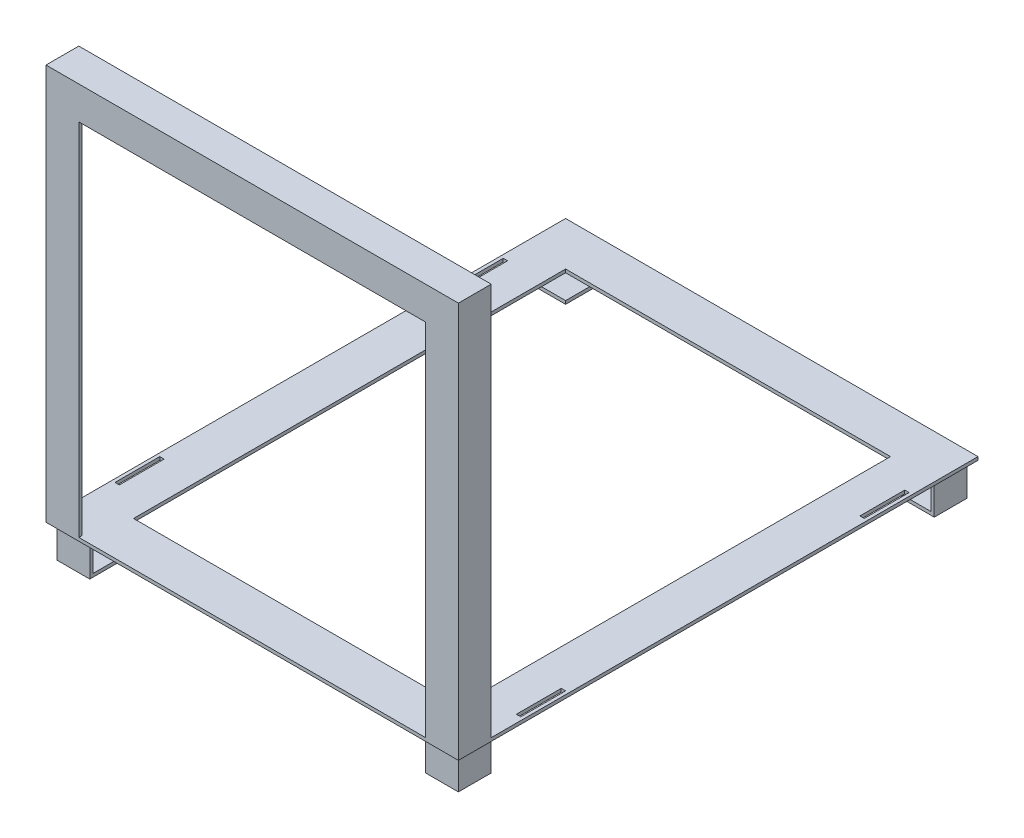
from build123d import *

# Parameters (mm, degrees)
SKETCH1_W           = 377
SKETCH1_H           = 475
SKETCH1_W_2         = 297
SKETCH1_H_2         = 395
BOSS_EXTRUDE1_DEPTH = 1.5
SKETCH2_W           = 4
SKETCH2_H           = 41
CUT_EXTRUDE1_DEPTH  = 3
BOSS_EXTRUDE2_DEPTH = 30
SKETCH4_W           = 30
SKETCH4_H           = 30
BOSS_EXTRUDE3_DEPTH = 3
BOSS_EXTRUDE4_DEPTH = 359
SKETCH6_W           = 377
SKETCH6_H           = 30
BOSS_EXTRUDE5_DEPTH = 3
SKETCH7_W           = 377
SKETCH7_H           = 30
BOSS_EXTRUDE6_DEPTH = 3


with BuildPart() as part:
    # Sketch1 → Boss-Extrude1 (new, symmetric)
    with BuildSketch(Plane(origin=(0, 0, 0), x_dir=(1, 0, 0), z_dir=(0, 1, 0))):
        Rectangle(SKETCH1_W, SKETCH1_H)
        Rectangle(SKETCH1_W_2, SKETCH1_H_2, mode=Mode.SUBTRACT)
    extrude(amount=BOSS_EXTRUDE1_DEPTH, both=True)

    # Sketch2 → Cut-Extrude1 (cut)
    with BuildSketch(Plane(origin=(0, 1.5, 0), x_dir=(1, 0, 0), z_dir=(0, 1, 0))):
        with Locations((183.5, -157)):
            Rectangle(SKETCH2_W, SKETCH2_H)
        with Locations((183.5, 157)):
            Rectangle(SKETCH2_W, SKETCH2_H)
        with Locations((-183.5, -157)):
            Rectangle(SKETCH2_W, SKETCH2_H)
        with Locations((-183.5, 157)):
            Rectangle(SKETCH2_W, SKETCH2_H)
    extrude(amount=-CUT_EXTRUDE1_DEPTH, mode=Mode.SUBTRACT)

    # Sketch3 → Boss-Extrude2 (add)
    with BuildSketch(Plane.XZ.offset(1.5)):
        Polygon((-183.5, 232.5), (-183.5, 202.5), (-180.5, 202.5), (-180.5, 229.5), (-153.5, 229.5), (-153.5, 232.5), align=None)
        Polygon((153.5, 232.5), (183.5, 232.5), (183.5, 202.5), (180.5, 202.5), (180.5, 229.5), (153.5, 229.5), align=None)
        Polygon((-183.5, -202.5), (-183.5, -232.5), (-153.5, -232.5), (-153.5, -229.5), (-180.5, -229.5), (-180.5, -202.5), align=None)
        Polygon((153.5, -229.5), (153.5, -232.5), (183.5, -232.5), (183.5, -202.5), (180.5, -202.5), (180.5, -229.5), align=None)
    extrude(amount=BOSS_EXTRUDE2_DEPTH)

    # Sketch4 → Boss-Extrude3 (add)
    with BuildSketch(Plane.XZ.offset(31.5)):
        with Locations((-168.5, -217.5)):
            Rectangle(SKETCH4_W, SKETCH4_H)
        with Locations((168.5, -217.5)):
            Rectangle(SKETCH4_W, SKETCH4_H)
        with Locations((168.5, 217.5)):
            Rectangle(SKETCH4_W, SKETCH4_H)
        with Locations((-168.5, 217.5)):
            Rectangle(SKETCH4_W, SKETCH4_H)
    extrude(amount=-BOSS_EXTRUDE3_DEPTH)

    # Sketch5 → Boss-Extrude4 (add)
    with BuildSketch(Plane(origin=(0, 1.5, 0), x_dir=(1, 0, 0), z_dir=(0, 1, 0))):
        Polygon((188.5, -237.5), (158.5, -237.5), (158.5, -234.5), (185.5, -234.5), (185.5, -207.5), (188.5, -207.5), align=None)
        Polygon((-188.5, -237.5), (-158.5, -237.5), (-158.5, -234.5), (-185.5, -234.5), (-185.5, -207.5), (-188.5, -207.5), align=None)
    extrude(amount=BOSS_EXTRUDE4_DEPTH)

    # Sketch6 → Boss-Extrude5 (add)
    with BuildSketch(Plane(origin=(0, 360.5, 0), x_dir=(1, 0, 0), z_dir=(0, 1, 0))):
        with Locations((0, -222.5)):
            Rectangle(SKETCH6_W, SKETCH6_H)
    extrude(amount=-BOSS_EXTRUDE5_DEPTH)

    # Sketch7 → Boss-Extrude6 (add)
    with BuildSketch(Plane.XY.offset(237.5)):
        with Locations((0, 345.5)):
            Rectangle(SKETCH7_W, SKETCH7_H)
    extrude(amount=-BOSS_EXTRUDE6_DEPTH)


solid = part.part
